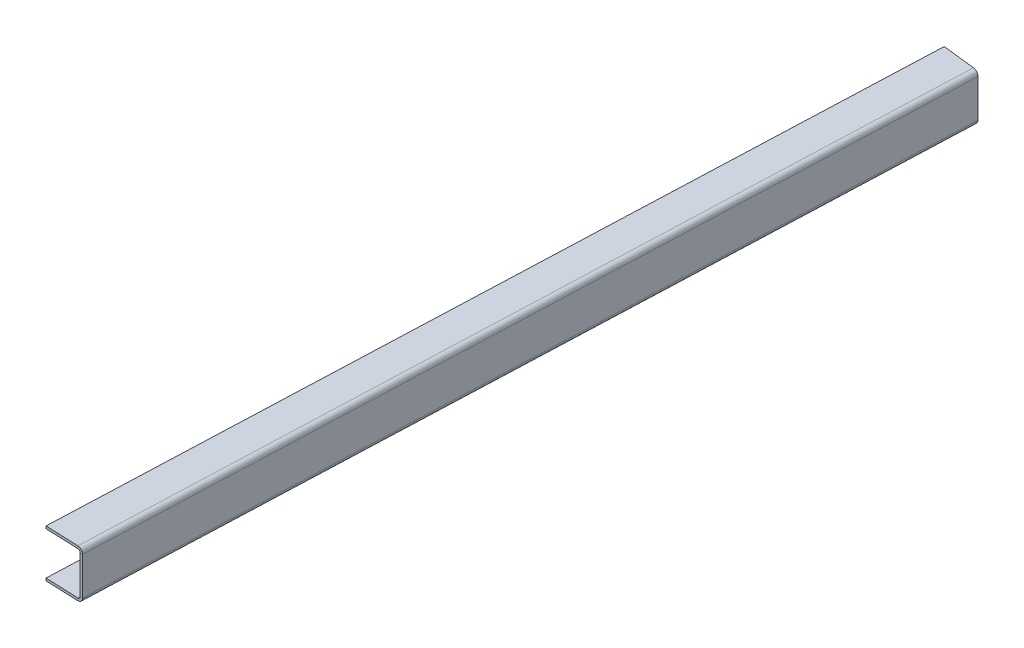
ISO-10303-21;
HEADER;
FILE_DESCRIPTION(('STEP AP214'),'2;1');
FILE_NAME('part.step','',(''),(''),'','','');
FILE_SCHEMA(('AUTOMOTIVE_DESIGN { 1 0 10303 214 1 1 1 1 }'));
ENDSEC;
DATA;
#1=APPLICATION_CONTEXT('core data for automotive mechanical design processes');
#2=APPLICATION_PROTOCOL_DEFINITION('international standard','automotive_design',2000,#1);
#3=PRODUCT_CONTEXT('',#1,'mechanical');
#4=PRODUCT('Part','Part','',(#3));
#5=PRODUCT_RELATED_PRODUCT_CATEGORY('part','',(#4));
#6=PRODUCT_DEFINITION_FORMATION('','',#4);
#7=PRODUCT_DEFINITION_CONTEXT('part definition',#1,'design');
#8=PRODUCT_DEFINITION('design','',#6,#7);
#9=PRODUCT_DEFINITION_SHAPE('','',#8);
#10=(LENGTH_UNIT() NAMED_UNIT(*) SI_UNIT(.MILLI.,.METRE.));
#11=(NAMED_UNIT(*) PLANE_ANGLE_UNIT() SI_UNIT($,.RADIAN.));
#12=(NAMED_UNIT(*) SI_UNIT($,.STERADIAN.) SOLID_ANGLE_UNIT());
#13=UNCERTAINTY_MEASURE_WITH_UNIT(LENGTH_MEASURE(1.E-05),#10,'distance_accuracy_value','');
#14=(GEOMETRIC_REPRESENTATION_CONTEXT(3) GLOBAL_UNCERTAINTY_ASSIGNED_CONTEXT((#13)) GLOBAL_UNIT_ASSIGNED_CONTEXT((#10,
#11,#12)) REPRESENTATION_CONTEXT('',''));
#15=CARTESIAN_POINT('',(0.,0.,0.));
#16=DIRECTION('',(0.,0.,1.));
#17=DIRECTION('',(1.,0.,0.));
#18=AXIS2_PLACEMENT_3D('',#15,#16,#17);
#19=CARTESIAN_POINT('',(-1473.71228253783,0.,-719.910081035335));
#20=DIRECTION('',(0.0392134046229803,0.,-0.999230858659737));
#21=DIRECTION('',(0.,1.,0.));
#22=AXIS2_PLACEMENT_3D('',#19,#20,#21);
#23=PLANE('',#22);
#24=DIRECTION('',(-0.999230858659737,0.,-0.0392134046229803));
#25=VECTOR('',#24,1.);
#26=CARTESIAN_POINT('',(-1473.71228253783,-28.4988000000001,-719.910081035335));
#27=LINE('',#26,#25);
#28=CARTESIAN_POINT('',(-1472.08793285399,-28.4988000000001,-719.84633572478));
#29=VERTEX_POINT('',#28);
#30=CARTESIAN_POINT('',(-1473.71228253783,-28.4988000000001,-719.910081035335));
#31=VERTEX_POINT('',#30);
#32=EDGE_CURVE('E12',#29,#31,#27,.T.);
#33=ORIENTED_EDGE('',*,*,#32,.F.);
#34=DIRECTION('',(0.,1.,0.));
#35=VECTOR('',#34,1.);
#36=CARTESIAN_POINT('',(-1472.08793285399,0.,-719.846335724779));
#37=LINE('',#36,#35);
#38=CARTESIAN_POINT('',(-1472.08793285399,-3.25120000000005,-719.846335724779));
#39=VERTEX_POINT('',#38);
#40=EDGE_CURVE('E137',#29,#39,#37,.T.);
#41=ORIENTED_EDGE('',*,*,#40,.T.);
#42=DIRECTION('',(-0.999230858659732,0.,-0.0392134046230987));
#43=VECTOR('',#42,1.);
#44=CARTESIAN_POINT('',(-1473.71228253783,-3.25120000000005,-719.910081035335));
#45=LINE('',#44,#43);
#46=CARTESIAN_POINT('',(-1473.71228253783,-3.25120000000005,-719.910081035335));
#47=VERTEX_POINT('',#46);
#48=EDGE_CURVE('E90',#39,#47,#45,.T.);
#49=ORIENTED_EDGE('',*,*,#48,.T.);
#50=DIRECTION('',(0.,1.,0.));
#51=VECTOR('',#50,1.);
#52=CARTESIAN_POINT('',(-1473.71228253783,0.,-719.910081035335));
#53=LINE('',#52,#51);
#54=EDGE_CURVE('E139',#31,#47,#53,.T.);
#55=ORIENTED_EDGE('',*,*,#54,.F.);
#56=EDGE_LOOP('',(#33,#41,#49,#55));
#57=FACE_BOUND('',#56,.T.);
#58=ADVANCED_FACE('F78',(#57),#23,.F.);
#59=CARTESIAN_POINT('',(-1476.96091077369,-3.25120000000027,-720.039384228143));
#60=CARTESIAN_POINT('',(-1477.5023606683,-3.25120000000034,-720.060632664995));
#61=CARTESIAN_POINT('',(-1478.04381056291,-3.25120000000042,-720.081881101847));
#62=CARTESIAN_POINT('',(-1478.58526045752,-3.25120000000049,-720.103129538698));
#63=CARTESIAN_POINT('',(-1476.96091077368,-6.50240000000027,-720.039384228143));
#64=CARTESIAN_POINT('',(-1477.5023606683,-7.58613333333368,-720.060632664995));
#65=CARTESIAN_POINT('',(-1478.04381056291,-8.66986666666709,-720.081881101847));
#66=CARTESIAN_POINT('',(-1478.58526045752,-9.75360000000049,-720.103129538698));
#67=CARTESIAN_POINT('',(-1473.71228253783,-6.50239999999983,-719.910081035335));
#68=CARTESIAN_POINT('',(-1473.17083264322,-7.58613333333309,-719.888832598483));
#69=CARTESIAN_POINT('',(-1472.6293827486,-8.66986666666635,-719.867584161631));
#70=CARTESIAN_POINT('',(-1472.08793285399,-9.75359999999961,-719.846335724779));
#71=CARTESIAN_POINT('',(-1473.71228253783,-3.25119999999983,-719.910081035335));
#72=CARTESIAN_POINT('',(-1473.17083264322,-3.25119999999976,-719.888832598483));
#73=CARTESIAN_POINT('',(-1472.6293827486,-3.25119999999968,-719.867584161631));
#74=CARTESIAN_POINT('',(-1472.08793285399,-3.25119999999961,-719.846335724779));
#75=CARTESIAN_POINT('',(-1473.71228253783,1.70870262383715E-13,-719.910081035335));
#76=CARTESIAN_POINT('',(-1473.17083264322,1.08373333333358,-719.888832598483));
#77=CARTESIAN_POINT('',(-1472.62938274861,2.16746666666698,-719.867584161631));
#78=CARTESIAN_POINT('',(-1472.08793285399,3.25120000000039,-719.846335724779));
#79=CARTESIAN_POINT('',(-1476.96091077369,-2.68882138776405E-13,-720.039384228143));
#80=CARTESIAN_POINT('',(-1477.5023606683,1.08373333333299,-720.060632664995));
#81=CARTESIAN_POINT('',(-1478.04381056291,2.16746666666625,-720.081881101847));
#82=CARTESIAN_POINT('',(-1478.58526045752,3.25119999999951,-720.103129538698));
#83=CARTESIAN_POINT('',(-1476.96091077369,-3.25120000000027,-720.039384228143));
#84=CARTESIAN_POINT('',(-1477.5023606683,-3.25120000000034,-720.060632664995));
#85=CARTESIAN_POINT('',(-1478.04381056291,-3.25120000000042,-720.081881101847));
#86=CARTESIAN_POINT('',(-1478.58526045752,-3.25120000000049,-720.103129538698));
#87=(BOUNDED_SURFACE() B_SPLINE_SURFACE(3,3,((#59,#60,#61,#62),(#63,#64,#65,#66),(#67,#68,#69,
#70),(#71,#72,#73,#74),(#75,#76,#77,#78),(#79,#80,#81,#82),(#83,#84,#85,#86)),.UNSPECIFIED.,.T.,
.F.,.F.) B_SPLINE_SURFACE_WITH_KNOTS((4,3,4),(4,4),(0.,0.5,1.),(0.,1.),
.UNSPECIFIED.) GEOMETRIC_REPRESENTATION_ITEM() RATIONAL_B_SPLINE_SURFACE(((1.,1.,1.,1.),
(0.333333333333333,0.333333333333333,0.333333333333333,0.333333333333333),(0.333333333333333,
0.333333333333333,0.333333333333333,0.333333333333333),(1.,1.,1.,1.),(0.333333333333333,
0.333333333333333,0.333333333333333,0.333333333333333),(0.333333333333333,0.333333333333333,
0.333333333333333,0.333333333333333),(1.,1.,1.,1.))) REPRESENTATION_ITEM('') SURFACE());
#88=CARTESIAN_POINT('',(-1475.33659665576,-3.25120000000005,-719.974732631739));
#89=DIRECTION('',(-0.0394921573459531,0.,0.999219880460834));
#90=DIRECTION('',(-0.999219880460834,-1.35258484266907E-13,-0.0394921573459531));
#91=AXIS2_PLACEMENT_3D('',#88,#89,#90);
#92=ELLIPSE('',#91,3.25120012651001,3.2512);
#93=CARTESIAN_POINT('',(-1475.33659665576,0.,-719.974732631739));
#94=VERTEX_POINT('',#93);
#95=EDGE_CURVE('E215',#39,#94,#92,.T.);
#96=DIRECTION('',(0.,-1.,0.));
#97=VECTOR('',#96,1.);
#98=CARTESIAN_POINT('',(-1475.33659665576,-1.62560000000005,-719.974732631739));
#99=LINE('',#98,#97);
#100=CARTESIAN_POINT('',(-1475.33659665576,-1.62560000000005,-719.974732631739));
#101=VERTEX_POINT('',#100);
#102=EDGE_CURVE('E205',#94,#101,#99,.T.);
#103=CARTESIAN_POINT('',(-1475.33659665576,-3.25120000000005,-719.974732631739));
#104=DIRECTION('',(-0.0397709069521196,0.,0.999208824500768));
#105=DIRECTION('',(-0.999208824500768,-1.353218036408E-13,-0.0397709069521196));
#106=AXIS2_PLACEMENT_3D('',#103,#104,#105);
#107=ELLIPSE('',#106,1.62560025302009,1.6256);
#108=EDGE_CURVE('E213',#47,#101,#107,.T.);
#109=ORIENTED_EDGE('',*,*,#48,.F.);
#110=ORIENTED_EDGE('',*,*,#95,.T.);
#111=ORIENTED_EDGE('',*,*,#102,.T.);
#112=ORIENTED_EDGE('',*,*,#108,.F.);
#113=EDGE_LOOP('',(#109,#110,#111,#112));
#114=FACE_BOUND('',#113,.T.);
#115=ADVANCED_FACE('F212',(#114),#87,.F.);
#116=CARTESIAN_POINT('',(-1497.47226716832,-1.62560000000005,-720.855785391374));
#117=DIRECTION('',(-0.0397709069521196,0.,0.999208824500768));
#118=DIRECTION('',(0.999208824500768,0.,0.0397709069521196));
#119=AXIS2_PLACEMENT_3D('',#116,#117,#118);
#120=PLANE('',#119);
#121=ORIENTED_EDGE('',*,*,#102,.F.);
#122=DIRECTION('',(0.999208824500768,0.,0.0397709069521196));
#123=VECTOR('',#122,1.);
#124=CARTESIAN_POINT('',(-1497.47226716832,0.,-720.855785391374));
#125=LINE('',#124,#123);
#126=CARTESIAN_POINT('',(-1497.47226716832,0.,-720.855785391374));
#127=VERTEX_POINT('',#126);
#128=EDGE_CURVE('E176',#127,#94,#125,.T.);
#129=ORIENTED_EDGE('',*,*,#128,.F.);
#130=DIRECTION('',(0.,-1.,0.));
#131=VECTOR('',#130,1.);
#132=CARTESIAN_POINT('',(-1497.47226716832,-1.62560000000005,-720.855785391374));
#133=LINE('',#132,#131);
#134=CARTESIAN_POINT('',(-1497.47226716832,-1.62560000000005,-720.855785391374));
#135=VERTEX_POINT('',#134);
#136=EDGE_CURVE('E202',#127,#135,#133,.T.);
#137=ORIENTED_EDGE('',*,*,#136,.T.);
#138=DIRECTION('',(0.999208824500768,0.,0.0397709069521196));
#139=VECTOR('',#138,1.);
#140=CARTESIAN_POINT('',(-1497.47226716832,-1.62560000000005,-720.855785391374));
#141=LINE('',#140,#139);
#142=EDGE_CURVE('E232',#135,#101,#141,.T.);
#143=ORIENTED_EDGE('',*,*,#142,.T.);
#144=EDGE_LOOP('',(#121,#129,#137,#143));
#145=FACE_BOUND('',#144,.T.);
#146=ADVANCED_FACE('F233',(#145),#120,.T.);
#147=CARTESIAN_POINT('',(-1474.82176907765,-1.62560000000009,-1298.03282150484));
#148=DIRECTION('',(-0.999230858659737,0.,-0.0392134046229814));
#149=DIRECTION('',(-0.0392134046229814,0.,0.999230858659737));
#150=AXIS2_PLACEMENT_3D('',#147,#148,#149);
#151=PLANE('',#150);
#152=ORIENTED_EDGE('',*,*,#136,.F.);
#153=DIRECTION('',(-0.0392134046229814,0.,0.999230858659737));
#154=VECTOR('',#153,1.);
#155=CARTESIAN_POINT('',(-1474.82176907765,0.,-1298.03282150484));
#156=LINE('',#155,#154);
#157=CARTESIAN_POINT('',(-1474.82176907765,0.,-1298.03282150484));
#158=VERTEX_POINT('',#157);
#159=EDGE_CURVE('E168',#158,#127,#156,.T.);
#160=ORIENTED_EDGE('',*,*,#159,.F.);
#161=DIRECTION('',(0.,-1.,0.));
#162=VECTOR('',#161,1.);
#163=CARTESIAN_POINT('',(-1474.82176907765,-1.62560000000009,-1298.03282150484));
#164=LINE('',#163,#162);
#165=CARTESIAN_POINT('',(-1474.82176907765,-1.62560000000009,-1298.03282150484));
#166=VERTEX_POINT('',#165);
#167=EDGE_CURVE('E199',#158,#166,#164,.T.);
#168=ORIENTED_EDGE('',*,*,#167,.T.);
#169=DIRECTION('',(-0.0392134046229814,0.,0.999230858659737));
#170=VECTOR('',#169,1.);
#171=CARTESIAN_POINT('',(-1474.82176907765,-1.62560000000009,-1298.03282150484));
#172=LINE('',#171,#170);
#173=EDGE_CURVE('E237',#166,#135,#172,.T.);
#174=ORIENTED_EDGE('',*,*,#173,.T.);
#175=EDGE_LOOP('',(#152,#160,#168,#174));
#176=FACE_BOUND('',#175,.T.);
#177=ADVANCED_FACE('F280',(#176),#151,.T.);
#178=CARTESIAN_POINT('',(-1449.51468815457,-1.62560000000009,-1295.16686788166));
#179=DIRECTION('',(0.112527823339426,0.,-0.993648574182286));
#180=DIRECTION('',(-0.993648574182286,0.,-0.112527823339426));
#181=AXIS2_PLACEMENT_3D('',#178,#179,#180);
#182=PLANE('',#181);
#183=ORIENTED_EDGE('',*,*,#167,.F.);
#184=DIRECTION('',(-0.993648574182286,0.,-0.112527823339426));
#185=VECTOR('',#184,1.);
#186=CARTESIAN_POINT('',(-1449.51468815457,0.,-1295.16686788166));
#187=LINE('',#186,#185);
#188=CARTESIAN_POINT('',(-1452.74961645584,0.,-1295.53321414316));
#189=VERTEX_POINT('',#188);
#190=EDGE_CURVE('E173',#189,#158,#187,.T.);
#191=ORIENTED_EDGE('',*,*,#190,.F.);
#192=DIRECTION('',(1.15249837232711E-13,-1.,-2.73184799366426E-13));
#193=VECTOR('',#192,1.);
#194=CARTESIAN_POINT('',(-1452.74961645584,-1.62560000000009,-1295.53321414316));
#195=LINE('',#194,#193);
#196=CARTESIAN_POINT('',(-1452.74961645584,-1.62560000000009,-1295.53321414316));
#197=VERTEX_POINT('',#196);
#198=EDGE_CURVE('E196',#189,#197,#195,.T.);
#199=ORIENTED_EDGE('',*,*,#198,.T.);
#200=DIRECTION('',(-0.993648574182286,0.,-0.112527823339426));
#201=VECTOR('',#200,1.);
#202=CARTESIAN_POINT('',(-1449.51468815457,-1.62560000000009,-1295.16686788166));
#203=LINE('',#202,#201);
#204=EDGE_CURVE('E238',#197,#166,#203,.T.);
#205=ORIENTED_EDGE('',*,*,#204,.T.);
#206=EDGE_LOOP('',(#183,#191,#199,#205));
#207=FACE_BOUND('',#206,.T.);
#208=ADVANCED_FACE('F307',(#207),#182,.T.);
#209=CARTESIAN_POINT('',(-1454.36926963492,-3.25120000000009,-1295.71663517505));
#210=CARTESIAN_POINT('',(-1454.91071952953,-3.25120000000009,-1295.7378836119));
#211=CARTESIAN_POINT('',(-1455.45216942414,-3.2512000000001,-1295.75913204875));
#212=CARTESIAN_POINT('',(-1455.99361931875,-3.2512000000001,-1295.7803804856));
#213=CARTESIAN_POINT('',(-1454.36926963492,0.,-1295.71663517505));
#214=CARTESIAN_POINT('',(-1454.91071952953,1.08373333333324,-1295.7378836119));
#215=CARTESIAN_POINT('',(-1455.45216942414,2.16746666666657,-1295.75913204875));
#216=CARTESIAN_POINT('',(-1455.99361931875,3.25119999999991,-1295.7803804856));
#217=CARTESIAN_POINT('',(-1451.12996327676,0.,-1295.34979311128));
#218=CARTESIAN_POINT('',(-1450.58851338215,1.08373333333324,-1295.32854467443));
#219=CARTESIAN_POINT('',(-1450.04706348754,2.16746666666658,-1295.30729623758));
#220=CARTESIAN_POINT('',(-1449.50561359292,3.25119999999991,-1295.28604780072));
#221=CARTESIAN_POINT('',(-1451.12996327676,-3.25120000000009,-1295.34979311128));
#222=CARTESIAN_POINT('',(-1450.58851338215,-3.25120000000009,-1295.32854467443));
#223=CARTESIAN_POINT('',(-1450.04706348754,-3.25120000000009,-1295.30729623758));
#224=CARTESIAN_POINT('',(-1449.50561359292,-3.25120000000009,-1295.28604780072));
#225=CARTESIAN_POINT('',(-1451.12996327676,-6.50240000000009,-1295.34979311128));
#226=CARTESIAN_POINT('',(-1450.58851338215,-7.58613333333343,-1295.32854467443));
#227=CARTESIAN_POINT('',(-1450.04706348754,-8.66986666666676,-1295.30729623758));
#228=CARTESIAN_POINT('',(-1449.50561359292,-9.75360000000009,-1295.28604780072));
#229=CARTESIAN_POINT('',(-1454.36926963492,-6.50240000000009,-1295.71663517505));
#230=CARTESIAN_POINT('',(-1454.91071952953,-7.58613333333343,-1295.7378836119));
#231=CARTESIAN_POINT('',(-1455.45216942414,-8.66986666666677,-1295.75913204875));
#232=CARTESIAN_POINT('',(-1455.99361931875,-9.7536000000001,-1295.7803804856));
#233=CARTESIAN_POINT('',(-1454.36926963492,-3.25120000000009,-1295.71663517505));
#234=CARTESIAN_POINT('',(-1454.91071952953,-3.25120000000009,-1295.7378836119));
#235=CARTESIAN_POINT('',(-1455.45216942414,-3.2512000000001,-1295.75913204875));
#236=CARTESIAN_POINT('',(-1455.99361931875,-3.2512000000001,-1295.7803804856));
#237=(BOUNDED_SURFACE() B_SPLINE_SURFACE(3,3,((#209,#210,#211,#212),(#213,#214,#215,#216),(#217,
#218,#219,#220),(#221,#222,#223,#224),(#225,#226,#227,#228),(#229,#230,#231,#232),(#233,#234,
#235,#236)),.UNSPECIFIED.,.T.,.F.,.F.) B_SPLINE_SURFACE_WITH_KNOTS((4,3,4),(4,4),(0.,0.5,1.),
(0.,1.),.UNSPECIFIED.) GEOMETRIC_REPRESENTATION_ITEM() RATIONAL_B_SPLINE_SURFACE(((1.,1.,1.,1.),
(0.333333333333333,0.333333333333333,0.333333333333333,0.333333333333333),(0.333333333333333,
0.333333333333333,0.333333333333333,0.333333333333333),(1.,1.,1.,1.),(0.333333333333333,
0.333333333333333,0.333333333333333,0.333333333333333),(0.333333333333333,0.333333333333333,
0.333333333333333,0.333333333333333),(1.,1.,1.,1.))) REPRESENTATION_ITEM('') SURFACE());
#238=CARTESIAN_POINT('',(-1452.74961645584,-3.25120000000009,-1295.53321414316));
#239=DIRECTION('',(0.0759715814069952,0.,-0.997109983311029));
#240=DIRECTION('',(-0.997109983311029,0.,-0.0759715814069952));
#241=AXIS2_PLACEMENT_3D('',#238,#239,#240);
#242=ELLIPSE('',#241,3.25340525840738,3.2512);
#243=CARTESIAN_POINT('',(-1449.50561359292,-3.25120000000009,-1295.28604780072));
#244=VERTEX_POINT('',#243);
#245=EDGE_CURVE('E178',#189,#244,#242,.T.);
#246=DIRECTION('',(-0.999230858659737,0.,-0.0392134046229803));
#247=VECTOR('',#246,1.);
#248=CARTESIAN_POINT('',(-1451.12996327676,-3.25120000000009,-1295.34979311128));
#249=LINE('',#248,#247);
#250=CARTESIAN_POINT('',(-1451.12996327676,-3.25120000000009,-1295.34979311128));
#251=VERTEX_POINT('',#250);
#252=EDGE_CURVE('E194',#244,#251,#249,.T.);
#253=CARTESIAN_POINT('',(-1452.74961645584,-3.25120000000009,-1295.53321414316));
#254=DIRECTION('',(0.112527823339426,0.,-0.993648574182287));
#255=DIRECTION('',(-0.993648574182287,0.,-0.112527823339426));
#256=AXIS2_PLACEMENT_3D('',#253,#254,#255);
#257=ELLIPSE('',#256,1.63000604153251,1.6256);
#258=EDGE_CURVE('E229',#197,#251,#257,.T.);
#259=ORIENTED_EDGE('',*,*,#198,.F.);
#260=ORIENTED_EDGE('',*,*,#245,.T.);
#261=ORIENTED_EDGE('',*,*,#252,.T.);
#262=ORIENTED_EDGE('',*,*,#258,.F.);
#263=EDGE_LOOP('',(#259,#260,#261,#262));
#264=FACE_BOUND('',#263,.T.);
#265=ADVANCED_FACE('F357',(#264),#237,.F.);
#266=CARTESIAN_POINT('',(-1451.12996327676,0.,-1295.34979311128));
#267=DIRECTION('',(-0.0392134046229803,0.,0.999230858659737));
#268=DIRECTION('',(0.,-1.,0.));
#269=AXIS2_PLACEMENT_3D('',#266,#267,#268);
#270=PLANE('',#269);
#271=ORIENTED_EDGE('',*,*,#252,.F.);
#272=DIRECTION('',(0.,1.,0.));
#273=VECTOR('',#272,1.);
#274=CARTESIAN_POINT('',(-1449.50561359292,0.,-1295.28604780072));
#275=LINE('',#274,#273);
#276=CARTESIAN_POINT('',(-1449.50561359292,-28.4988000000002,-1295.28604780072));
#277=VERTEX_POINT('',#276);
#278=EDGE_CURVE('E167',#244,#277,#275,.F.);
#279=ORIENTED_EDGE('',*,*,#278,.T.);
#280=DIRECTION('',(-0.999230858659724,0.,-0.0392134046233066));
#281=VECTOR('',#280,1.);
#282=CARTESIAN_POINT('',(-1451.12996327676,-28.4988000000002,-1295.34979311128));
#283=LINE('',#282,#281);
#284=CARTESIAN_POINT('',(-1451.12996327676,-28.4988000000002,-1295.34979311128));
#285=VERTEX_POINT('',#284);
#286=EDGE_CURVE('E191',#277,#285,#283,.T.);
#287=ORIENTED_EDGE('',*,*,#286,.T.);
#288=DIRECTION('',(0.,-1.,0.));
#289=VECTOR('',#288,1.);
#290=CARTESIAN_POINT('',(-1451.12996327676,0.,-1295.34979311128));
#291=LINE('',#290,#289);
#292=EDGE_CURVE('E284',#251,#285,#291,.T.);
#293=ORIENTED_EDGE('',*,*,#292,.F.);
#294=EDGE_LOOP('',(#271,#279,#287,#293));
#295=FACE_BOUND('',#294,.T.);
#296=ADVANCED_FACE('F322',(#295),#270,.F.);
#297=CARTESIAN_POINT('',(-1451.12996327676,-28.4988000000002,-1295.34979311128));
#298=CARTESIAN_POINT('',(-1450.58851338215,-28.4988000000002,-1295.32854467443));
#299=CARTESIAN_POINT('',(-1450.04706348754,-28.4988000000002,-1295.30729623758));
#300=CARTESIAN_POINT('',(-1449.50561359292,-28.4988000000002,-1295.28604780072));
#301=CARTESIAN_POINT('',(-1451.12996327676,-31.7500000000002,-1295.34979311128));
#302=CARTESIAN_POINT('',(-1450.58851338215,-32.8337333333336,-1295.32854467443));
#303=CARTESIAN_POINT('',(-1450.04706348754,-33.9174666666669,-1295.30729623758));
#304=CARTESIAN_POINT('',(-1449.50561359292,-35.0012000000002,-1295.28604780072));
#305=CARTESIAN_POINT('',(-1454.36926963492,-31.7500000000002,-1295.71663517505));
#306=CARTESIAN_POINT('',(-1454.91071952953,-32.8337333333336,-1295.7378836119));
#307=CARTESIAN_POINT('',(-1455.45216942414,-33.9174666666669,-1295.75913204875));
#308=CARTESIAN_POINT('',(-1455.99361931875,-35.0012000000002,-1295.7803804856));
#309=CARTESIAN_POINT('',(-1454.36926963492,-28.4988000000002,-1295.71663517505));
#310=CARTESIAN_POINT('',(-1454.91071952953,-28.4988000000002,-1295.7378836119));
#311=CARTESIAN_POINT('',(-1455.45216942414,-28.4988000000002,-1295.75913204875));
#312=CARTESIAN_POINT('',(-1455.99361931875,-28.4988000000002,-1295.7803804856));
#313=CARTESIAN_POINT('',(-1454.36926963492,-25.2476000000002,-1295.71663517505));
#314=CARTESIAN_POINT('',(-1454.91071952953,-24.1638666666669,-1295.7378836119));
#315=CARTESIAN_POINT('',(-1455.45216942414,-23.0801333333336,-1295.75913204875));
#316=CARTESIAN_POINT('',(-1455.99361931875,-21.9964000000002,-1295.7803804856));
#317=CARTESIAN_POINT('',(-1451.12996327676,-25.2476000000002,-1295.34979311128));
#318=CARTESIAN_POINT('',(-1450.58851338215,-24.1638666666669,-1295.32854467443));
#319=CARTESIAN_POINT('',(-1450.04706348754,-23.0801333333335,-1295.30729623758));
#320=CARTESIAN_POINT('',(-1449.50561359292,-21.9964000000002,-1295.28604780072));
#321=CARTESIAN_POINT('',(-1451.12996327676,-28.4988000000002,-1295.34979311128));
#322=CARTESIAN_POINT('',(-1450.58851338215,-28.4988000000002,-1295.32854467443));
#323=CARTESIAN_POINT('',(-1450.04706348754,-28.4988000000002,-1295.30729623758));
#324=CARTESIAN_POINT('',(-1449.50561359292,-28.4988000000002,-1295.28604780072));
#325=(BOUNDED_SURFACE() B_SPLINE_SURFACE(3,3,((#297,#298,#299,#300),(#301,#302,#303,#304),(#305,
#306,#307,#308),(#309,#310,#311,#312),(#313,#314,#315,#316),(#317,#318,#319,#320),(#321,#322,
#323,#324)),.UNSPECIFIED.,.T.,.F.,.F.) B_SPLINE_SURFACE_WITH_KNOTS((4,3,4),(4,4),(0.,0.5,1.),
(0.,1.),.UNSPECIFIED.) GEOMETRIC_REPRESENTATION_ITEM() RATIONAL_B_SPLINE_SURFACE(((1.,1.,1.,1.),
(0.333333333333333,0.333333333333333,0.333333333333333,0.333333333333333),(0.333333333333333,
0.333333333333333,0.333333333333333,0.333333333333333),(1.,1.,1.,1.),(0.333333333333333,
0.333333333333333,0.333333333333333,0.333333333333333),(0.333333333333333,0.333333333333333,
0.333333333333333,0.333333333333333),(1.,1.,1.,1.))) REPRESENTATION_ITEM('') SURFACE());
#326=CARTESIAN_POINT('',(-1452.74961645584,-28.4988000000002,-1295.53321414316));
#327=DIRECTION('',(0.0759715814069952,0.,-0.997109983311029));
#328=DIRECTION('',(0.997109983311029,0.,0.0759715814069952));
#329=AXIS2_PLACEMENT_3D('',#326,#327,#328);
#330=ELLIPSE('',#329,3.25340525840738,3.2512);
#331=CARTESIAN_POINT('',(-1452.74961645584,-31.7500000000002,-1295.53321414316));
#332=VERTEX_POINT('',#331);
#333=EDGE_CURVE('E155',#277,#332,#330,.T.);
#334=DIRECTION('',(0.,1.,0.));
#335=VECTOR('',#334,1.);
#336=CARTESIAN_POINT('',(-1452.74961645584,-30.1244000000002,-1295.53321414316));
#337=LINE('',#336,#335);
#338=CARTESIAN_POINT('',(-1452.74961645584,-30.1244000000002,-1295.53321414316));
#339=VERTEX_POINT('',#338);
#340=EDGE_CURVE('E188',#332,#339,#337,.T.);
#341=CARTESIAN_POINT('',(-1452.74961645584,-28.4988000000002,-1295.53321414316));
#342=DIRECTION('',(0.112527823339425,0.,-0.993648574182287));
#343=DIRECTION('',(0.993648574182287,0.,0.112527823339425));
#344=AXIS2_PLACEMENT_3D('',#341,#342,#343);
#345=ELLIPSE('',#344,1.63000604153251,1.6256);
#346=EDGE_CURVE('E254',#285,#339,#345,.T.);
#347=ORIENTED_EDGE('',*,*,#286,.F.);
#348=ORIENTED_EDGE('',*,*,#333,.T.);
#349=ORIENTED_EDGE('',*,*,#340,.T.);
#350=ORIENTED_EDGE('',*,*,#346,.F.);
#351=EDGE_LOOP('',(#347,#348,#349,#350));
#352=FACE_BOUND('',#351,.T.);
#353=ADVANCED_FACE('F326',(#352),#325,.F.);
#354=CARTESIAN_POINT('',(-1474.82176907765,-30.1244000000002,-1298.03282150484));
#355=DIRECTION('',(0.112527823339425,0.,-0.993648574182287));
#356=DIRECTION('',(0.993648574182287,0.,0.112527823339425));
#357=AXIS2_PLACEMENT_3D('',#354,#355,#356);
#358=PLANE('',#357);
#359=ORIENTED_EDGE('',*,*,#340,.F.);
#360=DIRECTION('',(0.993648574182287,0.,0.112527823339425));
#361=VECTOR('',#360,1.);
#362=CARTESIAN_POINT('',(-1474.82176907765,-31.7500000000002,-1298.03282150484));
#363=LINE('',#362,#361);
#364=CARTESIAN_POINT('',(-1474.82176907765,-31.7500000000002,-1298.03282150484));
#365=VERTEX_POINT('',#364);
#366=EDGE_CURVE('E262',#365,#332,#363,.T.);
#367=ORIENTED_EDGE('',*,*,#366,.F.);
#368=DIRECTION('',(0.,1.,0.));
#369=VECTOR('',#368,1.);
#370=CARTESIAN_POINT('',(-1474.82176907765,-30.1244000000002,-1298.03282150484));
#371=LINE('',#370,#369);
#372=CARTESIAN_POINT('',(-1474.82176907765,-30.1244000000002,-1298.03282150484));
#373=VERTEX_POINT('',#372);
#374=EDGE_CURVE('E185',#365,#373,#371,.T.);
#375=ORIENTED_EDGE('',*,*,#374,.T.);
#376=DIRECTION('',(0.993648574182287,0.,0.112527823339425));
#377=VECTOR('',#376,1.);
#378=CARTESIAN_POINT('',(-1474.82176907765,-30.1244000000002,-1298.03282150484));
#379=LINE('',#378,#377);
#380=EDGE_CURVE('E293',#373,#339,#379,.T.);
#381=ORIENTED_EDGE('',*,*,#380,.T.);
#382=EDGE_LOOP('',(#359,#367,#375,#381));
#383=FACE_BOUND('',#382,.T.);
#384=ADVANCED_FACE('F374',(#383),#358,.T.);
#385=CARTESIAN_POINT('',(-1497.47226716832,-30.1244000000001,-720.855785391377));
#386=DIRECTION('',(-0.999230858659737,0.,-0.0392134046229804));
#387=DIRECTION('',(0.0392134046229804,0.,-0.999230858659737));
#388=AXIS2_PLACEMENT_3D('',#385,#386,#387);
#389=PLANE('',#388);
#390=ORIENTED_EDGE('',*,*,#374,.F.);
#391=DIRECTION('',(0.0392134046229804,0.,-0.999230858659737));
#392=VECTOR('',#391,1.);
#393=CARTESIAN_POINT('',(-1497.47226716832,-31.7500000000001,-720.855785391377));
#394=LINE('',#393,#392);
#395=CARTESIAN_POINT('',(-1497.47226716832,-31.7500000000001,-720.855785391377));
#396=VERTEX_POINT('',#395);
#397=EDGE_CURVE('E255',#396,#365,#394,.T.);
#398=ORIENTED_EDGE('',*,*,#397,.F.);
#399=DIRECTION('',(0.,1.,0.));
#400=VECTOR('',#399,1.);
#401=CARTESIAN_POINT('',(-1497.47226716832,-30.1244000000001,-720.855785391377));
#402=LINE('',#401,#400);
#403=CARTESIAN_POINT('',(-1497.47226716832,-30.1244000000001,-720.855785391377));
#404=VERTEX_POINT('',#403);
#405=EDGE_CURVE('E182',#396,#404,#402,.T.);
#406=ORIENTED_EDGE('',*,*,#405,.T.);
#407=DIRECTION('',(0.0392134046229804,0.,-0.999230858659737));
#408=VECTOR('',#407,1.);
#409=CARTESIAN_POINT('',(-1497.47226716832,-30.1244000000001,-720.855785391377));
#410=LINE('',#409,#408);
#411=EDGE_CURVE('E296',#404,#373,#410,.T.);
#412=ORIENTED_EDGE('',*,*,#411,.T.);
#413=EDGE_LOOP('',(#390,#398,#406,#412));
#414=FACE_BOUND('',#413,.T.);
#415=ADVANCED_FACE('F382',(#414),#389,.T.);
#416=CARTESIAN_POINT('',(-1472.09235907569,-30.1244000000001,-719.845604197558));
#417=DIRECTION('',(-0.0397709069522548,0.,0.999208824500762));
#418=DIRECTION('',(-0.999208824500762,0.,-0.0397709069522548));
#419=AXIS2_PLACEMENT_3D('',#416,#417,#418);
#420=PLANE('',#419);
#421=ORIENTED_EDGE('',*,*,#405,.F.);
#422=DIRECTION('',(-0.999208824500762,0.,-0.0397709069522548));
#423=VECTOR('',#422,1.);
#424=CARTESIAN_POINT('',(-1472.09235907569,-31.7500000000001,-719.845604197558));
#425=LINE('',#424,#423);
#426=CARTESIAN_POINT('',(-1475.33659665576,-31.7500000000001,-719.974732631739));
#427=VERTEX_POINT('',#426);
#428=EDGE_CURVE('E259',#427,#396,#425,.T.);
#429=ORIENTED_EDGE('',*,*,#428,.F.);
#430=DIRECTION('',(0.,1.,-1.36592399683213E-13));
#431=VECTOR('',#430,1.);
#432=CARTESIAN_POINT('',(-1475.33659665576,-30.1244000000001,-719.974732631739));
#433=LINE('',#432,#431);
#434=CARTESIAN_POINT('',(-1475.33659665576,-30.1244000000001,-719.974732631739));
#435=VERTEX_POINT('',#434);
#436=EDGE_CURVE('E84',#427,#435,#433,.T.);
#437=ORIENTED_EDGE('',*,*,#436,.T.);
#438=DIRECTION('',(-0.999208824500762,0.,-0.0397709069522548));
#439=VECTOR('',#438,1.);
#440=CARTESIAN_POINT('',(-1472.09235907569,-30.1244000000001,-719.845604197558));
#441=LINE('',#440,#439);
#442=EDGE_CURVE('E290',#435,#404,#441,.T.);
#443=ORIENTED_EDGE('',*,*,#442,.T.);
#444=EDGE_LOOP('',(#421,#429,#437,#443));
#445=FACE_BOUND('',#444,.T.);
#446=ADVANCED_FACE('F386',(#445),#420,.T.);
#447=CARTESIAN_POINT('',(-1473.71228253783,-28.4987999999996,-719.910081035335));
#448=CARTESIAN_POINT('',(-1473.17083264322,-28.4987999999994,-719.888832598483));
#449=CARTESIAN_POINT('',(-1472.6293827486,-28.4987999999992,-719.867584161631));
#450=CARTESIAN_POINT('',(-1472.08793285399,-28.4987999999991,-719.84633572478));
#451=CARTESIAN_POINT('',(-1473.71228253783,-25.2475999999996,-719.910081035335));
#452=CARTESIAN_POINT('',(-1473.17083264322,-24.1638666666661,-719.888832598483));
#453=CARTESIAN_POINT('',(-1472.62938274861,-23.0801333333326,-719.867584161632));
#454=CARTESIAN_POINT('',(-1472.08793285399,-21.9963999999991,-719.84633572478));
#455=CARTESIAN_POINT('',(-1476.96091077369,-25.2476000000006,-720.039384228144));
#456=CARTESIAN_POINT('',(-1477.5023606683,-24.1638666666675,-720.060632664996));
#457=CARTESIAN_POINT('',(-1478.04381056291,-23.0801333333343,-720.081881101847));
#458=CARTESIAN_POINT('',(-1478.58526045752,-21.9964000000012,-720.103129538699));
#459=CARTESIAN_POINT('',(-1476.96091077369,-28.4988000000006,-720.039384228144));
#460=CARTESIAN_POINT('',(-1477.5023606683,-28.4988000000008,-720.060632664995));
#461=CARTESIAN_POINT('',(-1478.04381056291,-28.498800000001,-720.081881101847));
#462=CARTESIAN_POINT('',(-1478.58526045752,-28.4988000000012,-720.103129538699));
#463=CARTESIAN_POINT('',(-1476.96091077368,-31.7500000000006,-720.039384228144));
#464=CARTESIAN_POINT('',(-1477.5023606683,-32.8337333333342,-720.060632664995));
#465=CARTESIAN_POINT('',(-1478.04381056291,-33.9174666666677,-720.081881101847));
#466=CARTESIAN_POINT('',(-1478.58526045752,-35.0012000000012,-720.103129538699));
#467=CARTESIAN_POINT('',(-1473.71228253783,-31.7499999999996,-719.910081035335));
#468=CARTESIAN_POINT('',(-1473.17083264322,-32.8337333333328,-719.888832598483));
#469=CARTESIAN_POINT('',(-1472.6293827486,-33.9174666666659,-719.867584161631));
#470=CARTESIAN_POINT('',(-1472.08793285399,-35.0011999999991,-719.846335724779));
#471=CARTESIAN_POINT('',(-1473.71228253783,-28.4987999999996,-719.910081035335));
#472=CARTESIAN_POINT('',(-1473.17083264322,-28.4987999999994,-719.888832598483));
#473=CARTESIAN_POINT('',(-1472.6293827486,-28.4987999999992,-719.867584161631));
#474=CARTESIAN_POINT('',(-1472.08793285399,-28.4987999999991,-719.84633572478));
#475=(BOUNDED_SURFACE() B_SPLINE_SURFACE(3,3,((#447,#448,#449,#450),(#451,#452,#453,#454),(#455,
#456,#457,#458),(#459,#460,#461,#462),(#463,#464,#465,#466),(#467,#468,#469,#470),(#471,#472,
#473,#474)),.UNSPECIFIED.,.T.,.F.,.F.) B_SPLINE_SURFACE_WITH_KNOTS((4,3,4),(4,4),(0.,0.5,1.),
(0.,1.),.UNSPECIFIED.) GEOMETRIC_REPRESENTATION_ITEM() RATIONAL_B_SPLINE_SURFACE(((1.,1.,1.,1.),
(0.333333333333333,0.333333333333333,0.333333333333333,0.333333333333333),(0.333333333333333,
0.333333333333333,0.333333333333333,0.333333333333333),(1.,1.,1.,1.),(0.333333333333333,
0.333333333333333,0.333333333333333,0.333333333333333),(0.333333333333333,0.333333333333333,
0.333333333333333,0.333333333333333),(1.,1.,1.,1.))) REPRESENTATION_ITEM('') SURFACE());
#476=CARTESIAN_POINT('',(-1475.33659665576,-28.4988000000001,-719.974732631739));
#477=DIRECTION('',(-0.0394921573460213,0.,0.999219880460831));
#478=DIRECTION('',(0.999219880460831,3.24406936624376E-13,0.0394921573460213));
#479=AXIS2_PLACEMENT_3D('',#476,#477,#478);
#480=ELLIPSE('',#479,3.25120012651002,3.2512);
#481=EDGE_CURVE('E152',#427,#29,#480,.T.);
#482=CARTESIAN_POINT('',(-1475.33659665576,-28.4988000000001,-719.974732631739));
#483=DIRECTION('',(-0.0397709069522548,0.,0.999208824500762));
#484=DIRECTION('',(0.999208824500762,3.24004703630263E-13,0.0397709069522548));
#485=AXIS2_PLACEMENT_3D('',#482,#483,#484);
#486=ELLIPSE('',#485,1.62560025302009,1.6256);
#487=EDGE_CURVE('E250',#435,#31,#486,.T.);
#488=ORIENTED_EDGE('',*,*,#481,.T.);
#489=ORIENTED_EDGE('',*,*,#32,.T.);
#490=ORIENTED_EDGE('',*,*,#487,.F.);
#491=ORIENTED_EDGE('',*,*,#436,.F.);
#492=EDGE_LOOP('',(#488,#489,#490,#491));
#493=FACE_BOUND('',#492,.T.);
#494=ADVANCED_FACE('F80',(#493),#475,.F.);
#495=CARTESIAN_POINT('',(0.,-30.1244,0.));
#496=DIRECTION('',(0.,-1.,0.));
#497=DIRECTION('',(0.,0.,-1.));
#498=AXIS2_PLACEMENT_3D('',#495,#496,#497);
#499=PLANE('',#498);
#500=ORIENTED_EDGE('',*,*,#442,.F.);
#501=DIRECTION('',(0.0392134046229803,0.,-0.999230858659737));
#502=VECTOR('',#501,1.);
#503=CARTESIAN_POINT('',(-1452.7543129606,-30.1244000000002,-1295.41353842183));
#504=LINE('',#503,#502);
#505=EDGE_CURVE('E247',#435,#339,#504,.T.);
#506=ORIENTED_EDGE('',*,*,#505,.T.);
#507=ORIENTED_EDGE('',*,*,#380,.F.);
#508=ORIENTED_EDGE('',*,*,#411,.F.);
#509=EDGE_LOOP('',(#500,#506,#507,#508));
#510=FACE_BOUND('',#509,.T.);
#511=ADVANCED_FACE('F411',(#510),#499,.F.);
#512=CARTESIAN_POINT('',(-1499.65223871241,0.,-58.911503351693));
#513=DIRECTION('',(0.999230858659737,0.,0.0392134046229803));
#514=DIRECTION('',(0.0392134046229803,0.,-0.999230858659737));
#515=AXIS2_PLACEMENT_3D('',#512,#513,#514);
#516=PLANE('',#515);
#517=ORIENTED_EDGE('',*,*,#54,.T.);
#518=DIRECTION('',(-0.0392134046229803,0.,0.999230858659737));
#519=VECTOR('',#518,1.);
#520=CARTESIAN_POINT('',(-1451.12996327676,-3.25120000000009,-1295.34979311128));
#521=LINE('',#520,#519);
#522=EDGE_CURVE('E228',#47,#251,#521,.F.);
#523=ORIENTED_EDGE('',*,*,#522,.T.);
#524=ORIENTED_EDGE('',*,*,#292,.T.);
#525=DIRECTION('',(0.0392134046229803,0.,-0.999230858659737));
#526=VECTOR('',#525,1.);
#527=CARTESIAN_POINT('',(-1473.71228253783,-28.4988000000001,-719.910081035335));
#528=LINE('',#527,#526);
#529=EDGE_CURVE('E244',#285,#31,#528,.F.);
#530=ORIENTED_EDGE('',*,*,#529,.T.);
#531=EDGE_LOOP('',(#517,#523,#524,#530));
#532=FACE_BOUND('',#531,.T.);
#533=ADVANCED_FACE('F325',(#532),#516,.F.);
#534=CARTESIAN_POINT('',(0.,-1.6256,0.));
#535=DIRECTION('',(0.,1.,0.));
#536=DIRECTION('',(0.,0.,1.));
#537=AXIS2_PLACEMENT_3D('',#534,#535,#536);
#538=PLANE('',#537);
#539=ORIENTED_EDGE('',*,*,#204,.F.);
#540=DIRECTION('',(-0.0392134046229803,0.,0.999230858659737));
#541=VECTOR('',#540,1.);
#542=CARTESIAN_POINT('',(-1475.33663222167,-1.62560000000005,-719.97382634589));
#543=LINE('',#542,#541);
#544=EDGE_CURVE('E226',#197,#101,#543,.T.);
#545=ORIENTED_EDGE('',*,*,#544,.T.);
#546=ORIENTED_EDGE('',*,*,#142,.F.);
#547=ORIENTED_EDGE('',*,*,#173,.F.);
#548=EDGE_LOOP('',(#539,#545,#546,#547));
#549=FACE_BOUND('',#548,.T.);
#550=ADVANCED_FACE('F241',(#549),#538,.F.);
#551=CARTESIAN_POINT('',(-1501.27893030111,-28.4988,-58.9155725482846));
#552=DIRECTION('',(-0.0392134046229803,0.,0.999230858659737));
#553=DIRECTION('',(0.999230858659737,0.,0.0392134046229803));
#554=AXIS2_PLACEMENT_3D('',#551,#552,#553);
#555=CYLINDRICAL_SURFACE('',#554,1.6256);
#556=ORIENTED_EDGE('',*,*,#487,.T.);
#557=ORIENTED_EDGE('',*,*,#529,.F.);
#558=ORIENTED_EDGE('',*,*,#346,.T.);
#559=ORIENTED_EDGE('',*,*,#505,.F.);
#560=EDGE_LOOP('',(#556,#557,#558,#559));
#561=FACE_BOUND('',#560,.T.);
#562=ADVANCED_FACE('F327',(#561),#555,.F.);
#563=CARTESIAN_POINT('',(-1501.27893030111,-3.2512,-58.9155725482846));
#564=DIRECTION('',(0.0392134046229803,0.,-0.999230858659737));
#565=DIRECTION('',(-0.999230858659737,0.,-0.0392134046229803));
#566=AXIS2_PLACEMENT_3D('',#563,#564,#565);
#567=CYLINDRICAL_SURFACE('',#566,1.6256);
#568=ORIENTED_EDGE('',*,*,#258,.T.);
#569=ORIENTED_EDGE('',*,*,#522,.F.);
#570=ORIENTED_EDGE('',*,*,#108,.T.);
#571=ORIENTED_EDGE('',*,*,#544,.F.);
#572=EDGE_LOOP('',(#568,#569,#570,#571));
#573=FACE_BOUND('',#572,.T.);
#574=ADVANCED_FACE('F224',(#573),#567,.F.);
#575=CARTESIAN_POINT('',(0.,-31.75,0.));
#576=DIRECTION('',(0.,-1.,0.));
#577=DIRECTION('',(0.,0.,-1.));
#578=AXIS2_PLACEMENT_3D('',#575,#576,#577);
#579=PLANE('',#578);
#580=ORIENTED_EDGE('',*,*,#428,.T.);
#581=ORIENTED_EDGE('',*,*,#397,.T.);
#582=ORIENTED_EDGE('',*,*,#366,.T.);
#583=DIRECTION('',(-0.0392134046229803,0.,0.999230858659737));
#584=VECTOR('',#583,1.);
#585=CARTESIAN_POINT('',(-1501.27893030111,-31.75,-58.9155725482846));
#586=LINE('',#585,#584);
#587=EDGE_CURVE('E160',#427,#332,#586,.F.);
#588=ORIENTED_EDGE('',*,*,#587,.F.);
#589=EDGE_LOOP('',(#580,#581,#582,#588));
#590=FACE_BOUND('',#589,.T.);
#591=ADVANCED_FACE('F334',(#590),#579,.T.);
#592=CARTESIAN_POINT('',(-1498.02788902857,0.,-58.8477580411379));
#593=DIRECTION('',(0.999230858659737,0.,0.0392134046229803));
#594=DIRECTION('',(0.0392134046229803,0.,-0.999230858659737));
#595=AXIS2_PLACEMENT_3D('',#592,#593,#594);
#596=PLANE('',#595);
#597=ORIENTED_EDGE('',*,*,#40,.F.);
#598=DIRECTION('',(0.0392134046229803,0.,-0.999230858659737));
#599=VECTOR('',#598,1.);
#600=CARTESIAN_POINT('',(-1498.02788902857,-28.4988000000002,-58.8477580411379));
#601=LINE('',#600,#599);
#602=EDGE_CURVE('E149',#277,#29,#601,.F.);
#603=ORIENTED_EDGE('',*,*,#602,.F.);
#604=ORIENTED_EDGE('',*,*,#278,.F.);
#605=DIRECTION('',(0.0392134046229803,0.,-0.999230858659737));
#606=VECTOR('',#605,1.);
#607=CARTESIAN_POINT('',(-1498.02788902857,-3.25120000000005,-58.8477580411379));
#608=LINE('',#607,#606);
#609=EDGE_CURVE('E165',#39,#244,#608,.T.);
#610=ORIENTED_EDGE('',*,*,#609,.F.);
#611=EDGE_LOOP('',(#597,#603,#604,#610));
#612=FACE_BOUND('',#611,.T.);
#613=ADVANCED_FACE('F163',(#612),#596,.T.);
#614=CARTESIAN_POINT('',(0.,0.,0.));
#615=DIRECTION('',(0.,1.,0.));
#616=DIRECTION('',(0.,0.,1.));
#617=AXIS2_PLACEMENT_3D('',#614,#615,#616);
#618=PLANE('',#617);
#619=ORIENTED_EDGE('',*,*,#190,.T.);
#620=ORIENTED_EDGE('',*,*,#159,.T.);
#621=ORIENTED_EDGE('',*,*,#128,.T.);
#622=DIRECTION('',(0.0392134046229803,0.,-0.999230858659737));
#623=VECTOR('',#622,1.);
#624=CARTESIAN_POINT('',(-1501.27893030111,0.,-58.9155725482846));
#625=LINE('',#624,#623);
#626=EDGE_CURVE('E159',#189,#94,#625,.F.);
#627=ORIENTED_EDGE('',*,*,#626,.F.);
#628=EDGE_LOOP('',(#619,#620,#621,#627));
#629=FACE_BOUND('',#628,.T.);
#630=ADVANCED_FACE('F275',(#629),#618,.T.);
#631=CARTESIAN_POINT('',(-1501.27893030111,-28.4988,-58.9155725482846));
#632=DIRECTION('',(-0.0392134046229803,0.,0.999230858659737));
#633=DIRECTION('',(0.999230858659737,0.,0.0392134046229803));
#634=AXIS2_PLACEMENT_3D('',#631,#632,#633);
#635=CYLINDRICAL_SURFACE('',#634,3.2512);
#636=ORIENTED_EDGE('',*,*,#481,.F.);
#637=ORIENTED_EDGE('',*,*,#587,.T.);
#638=ORIENTED_EDGE('',*,*,#333,.F.);
#639=ORIENTED_EDGE('',*,*,#602,.T.);
#640=EDGE_LOOP('',(#636,#637,#638,#639));
#641=FACE_BOUND('',#640,.T.);
#642=ADVANCED_FACE('F150',(#641),#635,.T.);
#643=CARTESIAN_POINT('',(-1501.27893030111,-3.2512,-58.9155725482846));
#644=DIRECTION('',(0.0392134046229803,0.,-0.999230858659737));
#645=DIRECTION('',(-0.999230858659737,0.,-0.0392134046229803));
#646=AXIS2_PLACEMENT_3D('',#643,#644,#645);
#647=CYLINDRICAL_SURFACE('',#646,3.2512);
#648=ORIENTED_EDGE('',*,*,#245,.F.);
#649=ORIENTED_EDGE('',*,*,#626,.T.);
#650=ORIENTED_EDGE('',*,*,#95,.F.);
#651=ORIENTED_EDGE('',*,*,#609,.T.);
#652=EDGE_LOOP('',(#648,#649,#650,#651));
#653=FACE_BOUND('',#652,.T.);
#654=ADVANCED_FACE('F391',(#653),#647,.T.);
#655=CLOSED_SHELL('',(#58,#115,#146,#177,#208,#265,#296,#353,#384,#415,#446,#494,#511,#533,#550,
#562,#574,#591,#613,#630,#642,#654));
#656=MANIFOLD_SOLID_BREP('B2',#655);
#657=ADVANCED_BREP_SHAPE_REPRESENTATION('',(#18,#656),#14);
#658=SHAPE_DEFINITION_REPRESENTATION(#9,#657);
ENDSEC;
END-ISO-10303-21;
